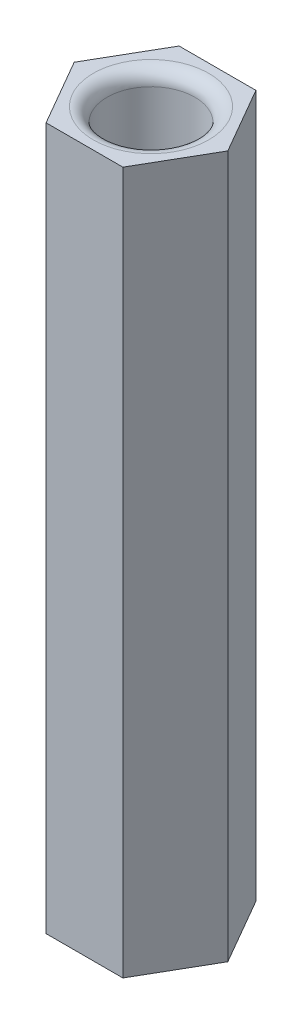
ISO-10303-21;
HEADER;
FILE_DESCRIPTION(('STEP AP214'),'2;1');
FILE_NAME('part.step','',(''),(''),'','','');
FILE_SCHEMA(('AUTOMOTIVE_DESIGN { 1 0 10303 214 1 1 1 1 }'));
ENDSEC;
DATA;
#1=APPLICATION_CONTEXT('core data for automotive mechanical design processes');
#2=APPLICATION_PROTOCOL_DEFINITION('international standard','automotive_design',2000,#1);
#3=PRODUCT_CONTEXT('',#1,'mechanical');
#4=PRODUCT('Part','Part','',(#3));
#5=PRODUCT_RELATED_PRODUCT_CATEGORY('part','',(#4));
#6=PRODUCT_DEFINITION_FORMATION('','',#4);
#7=PRODUCT_DEFINITION_CONTEXT('part definition',#1,'design');
#8=PRODUCT_DEFINITION('design','',#6,#7);
#9=PRODUCT_DEFINITION_SHAPE('','',#8);
#10=(LENGTH_UNIT() NAMED_UNIT(*) SI_UNIT(.MILLI.,.METRE.));
#11=(NAMED_UNIT(*) PLANE_ANGLE_UNIT() SI_UNIT($,.RADIAN.));
#12=(NAMED_UNIT(*) SI_UNIT($,.STERADIAN.) SOLID_ANGLE_UNIT());
#13=UNCERTAINTY_MEASURE_WITH_UNIT(LENGTH_MEASURE(1.E-05),#10,'distance_accuracy_value','');
#14=(GEOMETRIC_REPRESENTATION_CONTEXT(3) GLOBAL_UNCERTAINTY_ASSIGNED_CONTEXT((#13)) GLOBAL_UNIT_ASSIGNED_CONTEXT((#10,
#11,#12)) REPRESENTATION_CONTEXT('',''));
#15=CARTESIAN_POINT('',(0.,0.,0.));
#16=DIRECTION('',(0.,0.,1.));
#17=DIRECTION('',(1.,0.,0.));
#18=AXIS2_PLACEMENT_3D('',#15,#16,#17);
#19=CARTESIAN_POINT('',(2.778125,0.,0.));
#20=DIRECTION('',(0.866025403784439,0.,0.5));
#21=DIRECTION('',(-0.5,0.,0.866025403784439));
#22=AXIS2_PLACEMENT_3D('',#19,#20,#21);
#23=PLANE('',#22);
#24=DIRECTION('',(-0.500000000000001,0.,0.866025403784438));
#25=VECTOR('',#24,1.);
#26=CARTESIAN_POINT('',(2.778125,25.4,0.));
#27=LINE('',#26,#25);
#28=CARTESIAN_POINT('',(2.778125,25.4,0.));
#29=VERTEX_POINT('',#28);
#30=CARTESIAN_POINT('',(1.3890625,25.4,2.40592682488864));
#31=VERTEX_POINT('',#30);
#32=EDGE_CURVE('E93',#29,#31,#27,.T.);
#33=ORIENTED_EDGE('',*,*,#32,.T.);
#34=DIRECTION('',(0.,1.,0.));
#35=VECTOR('',#34,1.);
#36=CARTESIAN_POINT('',(1.3890625,0.,2.40592682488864));
#37=LINE('',#36,#35);
#38=CARTESIAN_POINT('',(1.3890625,0.,2.40592682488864));
#39=VERTEX_POINT('',#38);
#40=EDGE_CURVE('E38',#31,#39,#37,.F.);
#41=ORIENTED_EDGE('',*,*,#40,.T.);
#42=DIRECTION('',(-0.500000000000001,0.,0.866025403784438));
#43=VECTOR('',#42,1.);
#44=CARTESIAN_POINT('',(2.778125,0.,0.));
#45=LINE('',#44,#43);
#46=CARTESIAN_POINT('',(2.778125,0.,0.));
#47=VERTEX_POINT('',#46);
#48=EDGE_CURVE('E99',#47,#39,#45,.T.);
#49=ORIENTED_EDGE('',*,*,#48,.F.);
#50=DIRECTION('',(0.,1.,0.));
#51=VECTOR('',#50,1.);
#52=CARTESIAN_POINT('',(2.778125,0.,0.));
#53=LINE('',#52,#51);
#54=EDGE_CURVE('E88',#47,#29,#53,.T.);
#55=ORIENTED_EDGE('',*,*,#54,.T.);
#56=EDGE_LOOP('',(#33,#41,#49,#55));
#57=FACE_BOUND('',#56,.T.);
#58=ADVANCED_FACE('F35',(#57),#23,.T.);
#59=CARTESIAN_POINT('',(1.3890625,0.,2.40592682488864));
#60=DIRECTION('',(0.,0.,1.));
#61=DIRECTION('',(-1.,0.,0.));
#62=AXIS2_PLACEMENT_3D('',#59,#60,#61);
#63=PLANE('',#62);
#64=DIRECTION('',(1.,0.,0.));
#65=VECTOR('',#64,1.);
#66=CARTESIAN_POINT('',(0.,25.4,2.40592682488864));
#67=LINE('',#66,#65);
#68=CARTESIAN_POINT('',(-1.3890625,25.4,2.40592682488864));
#69=VERTEX_POINT('',#68);
#70=EDGE_CURVE('E104',#31,#69,#67,.F.);
#71=ORIENTED_EDGE('',*,*,#70,.T.);
#72=DIRECTION('',(0.,1.,0.));
#73=VECTOR('',#72,1.);
#74=CARTESIAN_POINT('',(-1.3890625,0.,2.40592682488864));
#75=LINE('',#74,#73);
#76=CARTESIAN_POINT('',(-1.3890625,0.,2.40592682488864));
#77=VERTEX_POINT('',#76);
#78=EDGE_CURVE('E214',#69,#77,#75,.F.);
#79=ORIENTED_EDGE('',*,*,#78,.T.);
#80=DIRECTION('',(1.,0.,0.));
#81=VECTOR('',#80,1.);
#82=CARTESIAN_POINT('',(0.,0.,2.40592682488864));
#83=LINE('',#82,#81);
#84=EDGE_CURVE('E164',#39,#77,#83,.F.);
#85=ORIENTED_EDGE('',*,*,#84,.F.);
#86=ORIENTED_EDGE('',*,*,#40,.F.);
#87=EDGE_LOOP('',(#71,#79,#85,#86));
#88=FACE_BOUND('',#87,.T.);
#89=ADVANCED_FACE('F205',(#88),#63,.T.);
#90=CARTESIAN_POINT('',(-1.3890625,0.,2.40592682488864));
#91=DIRECTION('',(-0.866025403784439,0.,0.5));
#92=DIRECTION('',(-0.5,0.,-0.866025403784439));
#93=AXIS2_PLACEMENT_3D('',#90,#91,#92);
#94=PLANE('',#93);
#95=DIRECTION('',(-0.500000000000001,0.,-0.866025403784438));
#96=VECTOR('',#95,1.);
#97=CARTESIAN_POINT('',(-1.3890625,25.4,2.40592682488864));
#98=LINE('',#97,#96);
#99=CARTESIAN_POINT('',(-2.778125,25.4,0.));
#100=VERTEX_POINT('',#99);
#101=EDGE_CURVE('E107',#69,#100,#98,.T.);
#102=ORIENTED_EDGE('',*,*,#101,.T.);
#103=DIRECTION('',(0.,1.,0.));
#104=VECTOR('',#103,1.);
#105=CARTESIAN_POINT('',(-2.778125,0.,0.));
#106=LINE('',#105,#104);
#107=CARTESIAN_POINT('',(-2.778125,0.,0.));
#108=VERTEX_POINT('',#107);
#109=EDGE_CURVE('E215',#100,#108,#106,.F.);
#110=ORIENTED_EDGE('',*,*,#109,.T.);
#111=DIRECTION('',(-0.500000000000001,0.,-0.866025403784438));
#112=VECTOR('',#111,1.);
#113=CARTESIAN_POINT('',(-1.3890625,0.,2.40592682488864));
#114=LINE('',#113,#112);
#115=EDGE_CURVE('E161',#77,#108,#114,.T.);
#116=ORIENTED_EDGE('',*,*,#115,.F.);
#117=ORIENTED_EDGE('',*,*,#78,.F.);
#118=EDGE_LOOP('',(#102,#110,#116,#117));
#119=FACE_BOUND('',#118,.T.);
#120=ADVANCED_FACE('F202',(#119),#94,.T.);
#121=CARTESIAN_POINT('',(-2.778125,0.,0.));
#122=DIRECTION('',(-0.866025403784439,0.,-0.5));
#123=DIRECTION('',(0.5,0.,-0.866025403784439));
#124=AXIS2_PLACEMENT_3D('',#121,#122,#123);
#125=PLANE('',#124);
#126=DIRECTION('',(0.499999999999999,0.,-0.866025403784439));
#127=VECTOR('',#126,1.);
#128=CARTESIAN_POINT('',(-2.778125,25.4,0.));
#129=LINE('',#128,#127);
#130=CARTESIAN_POINT('',(-1.3890625,25.4,-2.40592682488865));
#131=VERTEX_POINT('',#130);
#132=EDGE_CURVE('E223',#100,#131,#129,.T.);
#133=ORIENTED_EDGE('',*,*,#132,.T.);
#134=DIRECTION('',(0.,1.,0.));
#135=VECTOR('',#134,1.);
#136=CARTESIAN_POINT('',(-1.3890625,0.,-2.40592682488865));
#137=LINE('',#136,#135);
#138=CARTESIAN_POINT('',(-1.3890625,0.,-2.40592682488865));
#139=VERTEX_POINT('',#138);
#140=EDGE_CURVE('E100',#131,#139,#137,.F.);
#141=ORIENTED_EDGE('',*,*,#140,.T.);
#142=DIRECTION('',(0.499999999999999,0.,-0.866025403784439));
#143=VECTOR('',#142,1.);
#144=CARTESIAN_POINT('',(-2.778125,0.,0.));
#145=LINE('',#144,#143);
#146=EDGE_CURVE('E158',#108,#139,#145,.T.);
#147=ORIENTED_EDGE('',*,*,#146,.F.);
#148=ORIENTED_EDGE('',*,*,#109,.F.);
#149=EDGE_LOOP('',(#133,#141,#147,#148));
#150=FACE_BOUND('',#149,.T.);
#151=ADVANCED_FACE('F198',(#150),#125,.T.);
#152=CARTESIAN_POINT('',(-1.3890625,0.,-2.40592682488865));
#153=DIRECTION('',(0.,0.,-1.));
#154=DIRECTION('',(1.,0.,0.));
#155=AXIS2_PLACEMENT_3D('',#152,#153,#154);
#156=PLANE('',#155);
#157=DIRECTION('',(1.,0.,0.));
#158=VECTOR('',#157,1.);
#159=CARTESIAN_POINT('',(0.,25.4,-2.40592682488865));
#160=LINE('',#159,#158);
#161=CARTESIAN_POINT('',(1.3890625,25.4,-2.40592682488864));
#162=VERTEX_POINT('',#161);
#163=EDGE_CURVE('E168',#131,#162,#160,.T.);
#164=ORIENTED_EDGE('',*,*,#163,.T.);
#165=DIRECTION('',(0.,1.,0.));
#166=VECTOR('',#165,1.);
#167=CARTESIAN_POINT('',(1.3890625,0.,-2.40592682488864));
#168=LINE('',#167,#166);
#169=CARTESIAN_POINT('',(1.3890625,0.,-2.40592682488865));
#170=VERTEX_POINT('',#169);
#171=EDGE_CURVE('E91',#162,#170,#168,.F.);
#172=ORIENTED_EDGE('',*,*,#171,.T.);
#173=DIRECTION('',(1.,0.,0.));
#174=VECTOR('',#173,1.);
#175=CARTESIAN_POINT('',(0.,0.,-2.40592682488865));
#176=LINE('',#175,#174);
#177=EDGE_CURVE('E156',#139,#170,#176,.T.);
#178=ORIENTED_EDGE('',*,*,#177,.F.);
#179=ORIENTED_EDGE('',*,*,#140,.F.);
#180=EDGE_LOOP('',(#164,#172,#178,#179));
#181=FACE_BOUND('',#180,.T.);
#182=ADVANCED_FACE('F195',(#181),#156,.T.);
#183=CARTESIAN_POINT('',(1.3890625,0.,-2.40592682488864));
#184=DIRECTION('',(0.866025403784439,0.,-0.5));
#185=DIRECTION('',(0.5,0.,0.866025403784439));
#186=AXIS2_PLACEMENT_3D('',#183,#184,#185);
#187=PLANE('',#186);
#188=DIRECTION('',(0.5,0.,0.866025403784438));
#189=VECTOR('',#188,1.);
#190=CARTESIAN_POINT('',(1.3890625,25.4,-2.40592682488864));
#191=LINE('',#190,#189);
#192=EDGE_CURVE('E85',#162,#29,#191,.T.);
#193=ORIENTED_EDGE('',*,*,#192,.T.);
#194=ORIENTED_EDGE('',*,*,#54,.F.);
#195=DIRECTION('',(0.5,0.,0.866025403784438));
#196=VECTOR('',#195,1.);
#197=CARTESIAN_POINT('',(1.3890625,0.,-2.40592682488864));
#198=LINE('',#197,#196);
#199=EDGE_CURVE('E53',#170,#47,#198,.T.);
#200=ORIENTED_EDGE('',*,*,#199,.F.);
#201=ORIENTED_EDGE('',*,*,#171,.F.);
#202=EDGE_LOOP('',(#193,#194,#200,#201));
#203=FACE_BOUND('',#202,.T.);
#204=ADVANCED_FACE('F87',(#203),#187,.T.);
#205=CARTESIAN_POINT('',(0.,25.4,0.));
#206=DIRECTION('',(0.,1.,0.));
#207=DIRECTION('',(0.,0.,-1.));
#208=AXIS2_PLACEMENT_3D('',#205,#206,#207);
#209=PLANE('',#208);
#210=CARTESIAN_POINT('',(0.,25.4,0.));
#211=DIRECTION('',(0.,1.,0.));
#212=DIRECTION('',(1.,0.,0.));
#213=AXIS2_PLACEMENT_3D('',#210,#211,#212);
#214=CIRCLE('',#213,2.0875);
#215=CARTESIAN_POINT('',(2.0875,25.4,0.));
#216=VERTEX_POINT('',#215);
#217=EDGE_CURVE('E115',#216,#216,#214,.F.);
#218=ORIENTED_EDGE('',*,*,#217,.T.);
#219=EDGE_LOOP('',(#218));
#220=FACE_BOUND('',#219,.T.);
#221=ORIENTED_EDGE('',*,*,#132,.F.);
#222=ORIENTED_EDGE('',*,*,#101,.F.);
#223=ORIENTED_EDGE('',*,*,#70,.F.);
#224=ORIENTED_EDGE('',*,*,#32,.F.);
#225=ORIENTED_EDGE('',*,*,#192,.F.);
#226=ORIENTED_EDGE('',*,*,#163,.F.);
#227=EDGE_LOOP('',(#221,#222,#223,#224,#225,#226));
#228=FACE_BOUND('',#227,.T.);
#229=ADVANCED_FACE('F102',(#220,#228),#209,.T.);
#230=CARTESIAN_POINT('',(0.,0.,0.));
#231=DIRECTION('',(0.,1.,0.));
#232=DIRECTION('',(0.,0.,-1.));
#233=AXIS2_PLACEMENT_3D('',#230,#231,#232);
#234=PLANE('',#233);
#235=CARTESIAN_POINT('',(0.,0.,0.));
#236=DIRECTION('',(0.,-1.,0.));
#237=DIRECTION('',(-1.,0.,0.));
#238=AXIS2_PLACEMENT_3D('',#235,#236,#237);
#239=CIRCLE('',#238,2.0875);
#240=CARTESIAN_POINT('',(-2.0875,0.,0.));
#241=VERTEX_POINT('',#240);
#242=EDGE_CURVE('E146',#241,#241,#239,.F.);
#243=ORIENTED_EDGE('',*,*,#242,.T.);
#244=EDGE_LOOP('',(#243));
#245=FACE_BOUND('',#244,.T.);
#246=ORIENTED_EDGE('',*,*,#177,.T.);
#247=ORIENTED_EDGE('',*,*,#199,.T.);
#248=ORIENTED_EDGE('',*,*,#48,.T.);
#249=ORIENTED_EDGE('',*,*,#84,.T.);
#250=ORIENTED_EDGE('',*,*,#115,.T.);
#251=ORIENTED_EDGE('',*,*,#146,.T.);
#252=EDGE_LOOP('',(#246,#247,#248,#249,#250,#251));
#253=FACE_BOUND('',#252,.T.);
#254=ADVANCED_FACE('F132',(#245,#253),#234,.F.);
#255=CARTESIAN_POINT('',(0.,24.9,0.));
#256=DIRECTION('',(0.,-1.,0.));
#257=DIRECTION('',(0.,0.,1.));
#258=AXIS2_PLACEMENT_3D('',#255,#256,#257);
#259=TOROIDAL_SURFACE('',#258,2.0875,0.5);
#260=ORIENTED_EDGE('',*,*,#217,.F.);
#261=EDGE_LOOP('',(#260));
#262=FACE_BOUND('',#261,.T.);
#263=CARTESIAN_POINT('',(0.,24.9,0.));
#264=DIRECTION('',(0.,-1.,0.));
#265=DIRECTION('',(0.,0.,-1.));
#266=AXIS2_PLACEMENT_3D('',#263,#264,#265);
#267=CIRCLE('',#266,1.5875);
#268=CARTESIAN_POINT('',(0.,24.9,-1.5875));
#269=VERTEX_POINT('',#268);
#270=EDGE_CURVE('E44',#269,#269,#267,.F.);
#271=ORIENTED_EDGE('',*,*,#270,.F.);
#272=EDGE_LOOP('',(#271));
#273=FACE_BOUND('',#272,.T.);
#274=ADVANCED_FACE('F120',(#262,#273),#259,.T.);
#275=CARTESIAN_POINT('',(0.,0.5,0.));
#276=DIRECTION('',(0.,1.,0.));
#277=DIRECTION('',(0.,0.,-1.));
#278=AXIS2_PLACEMENT_3D('',#275,#276,#277);
#279=TOROIDAL_SURFACE('',#278,2.0875,0.5);
#280=ORIENTED_EDGE('',*,*,#242,.F.);
#281=EDGE_LOOP('',(#280));
#282=FACE_BOUND('',#281,.T.);
#283=CARTESIAN_POINT('',(0.,0.5,0.));
#284=DIRECTION('',(0.,-1.,0.));
#285=DIRECTION('',(0.,0.,-1.));
#286=AXIS2_PLACEMENT_3D('',#283,#284,#285);
#287=CIRCLE('',#286,1.5875);
#288=CARTESIAN_POINT('',(0.,0.5,-1.5875));
#289=VERTEX_POINT('',#288);
#290=EDGE_CURVE('E11',#289,#289,#287,.T.);
#291=ORIENTED_EDGE('',*,*,#290,.F.);
#292=EDGE_LOOP('',(#291));
#293=FACE_BOUND('',#292,.T.);
#294=ADVANCED_FACE('F131',(#282,#293),#279,.T.);
#295=CARTESIAN_POINT('',(0.,-1.04212263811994,0.));
#296=DIRECTION('',(0.,1.,0.));
#297=DIRECTION('',(0.,0.,-1.));
#298=AXIS2_PLACEMENT_3D('',#295,#296,#297);
#299=CYLINDRICAL_SURFACE('',#298,1.5875);
#300=ORIENTED_EDGE('',*,*,#290,.T.);
#301=EDGE_LOOP('',(#300));
#302=FACE_BOUND('',#301,.T.);
#303=ORIENTED_EDGE('',*,*,#270,.T.);
#304=EDGE_LOOP('',(#303));
#305=FACE_BOUND('',#304,.T.);
#306=ADVANCED_FACE('F243',(#302,#305),#299,.F.);
#307=CLOSED_SHELL('',(#58,#89,#120,#151,#182,#204,#229,#254,#274,#294,#306));
#308=MANIFOLD_SOLID_BREP('B2',#307);
#309=ADVANCED_BREP_SHAPE_REPRESENTATION('',(#18,#308),#14);
#310=SHAPE_DEFINITION_REPRESENTATION(#9,#309);
ENDSEC;
END-ISO-10303-21;
